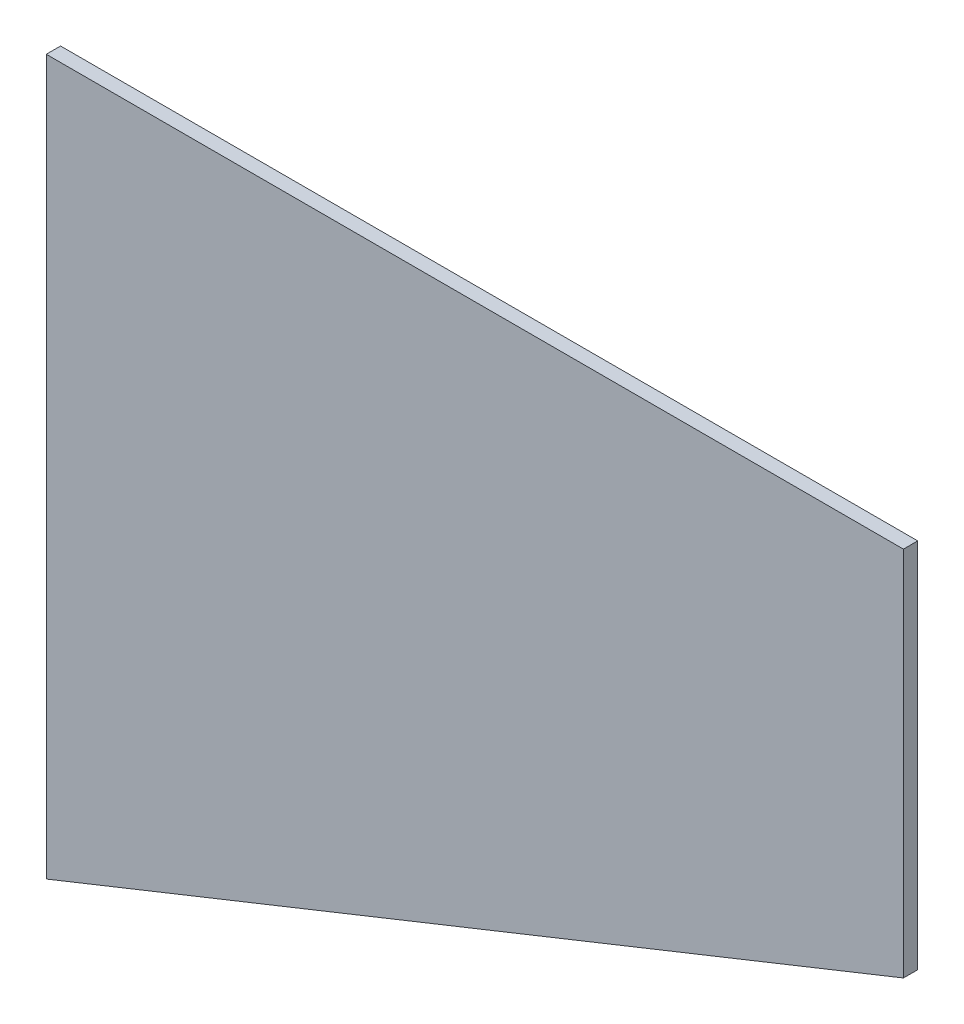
from build123d import *


with BuildPart() as part:
    # Sketch1 → Tapered_plywood_panel section 0
    with BuildSketch(Plane.YZ):
        with BuildLine():
            Line((-158.75, 152.4), (158.75, 152.4))
            Line((158.75, 152.4), (158.75, 158.75))
            Line((158.75, 158.75), (-158.75, 158.75))
            Line((-158.75, 158.75), (-158.75, 152.4))
        make_face()
    # Sketch2 → Tapered_plywood_panel section 1
    with BuildSketch(Plane.YZ.offset(304.8)):
        with BuildLine():
            Line((-82.55, 76.2), (82.55, 76.2))
            Line((82.55, 76.2), (82.55, 82.55))
            Line((82.55, 82.55), (-82.55, 82.55))
            Line((-82.55, 82.55), (-82.55, 76.2))
        make_face()
    loft()


solid = part.part
